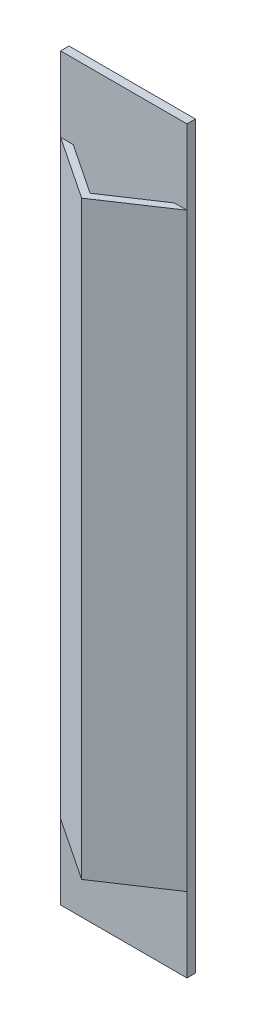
ISO-10303-21;
HEADER;
FILE_DESCRIPTION(('STEP AP214'),'2;1');
FILE_NAME('part.step','',(''),(''),'','','');
FILE_SCHEMA(('AUTOMOTIVE_DESIGN { 1 0 10303 214 1 1 1 1 }'));
ENDSEC;
DATA;
#1=APPLICATION_CONTEXT('core data for automotive mechanical design processes');
#2=APPLICATION_PROTOCOL_DEFINITION('international standard','automotive_design',2000,#1);
#3=PRODUCT_CONTEXT('',#1,'mechanical');
#4=PRODUCT('Part','Part','',(#3));
#5=PRODUCT_RELATED_PRODUCT_CATEGORY('part','',(#4));
#6=PRODUCT_DEFINITION_FORMATION('','',#4);
#7=PRODUCT_DEFINITION_CONTEXT('part definition',#1,'design');
#8=PRODUCT_DEFINITION('design','',#6,#7);
#9=PRODUCT_DEFINITION_SHAPE('','',#8);
#10=(LENGTH_UNIT() NAMED_UNIT(*) SI_UNIT(.MILLI.,.METRE.));
#11=(NAMED_UNIT(*) PLANE_ANGLE_UNIT() SI_UNIT($,.RADIAN.));
#12=(NAMED_UNIT(*) SI_UNIT($,.STERADIAN.) SOLID_ANGLE_UNIT());
#13=UNCERTAINTY_MEASURE_WITH_UNIT(LENGTH_MEASURE(1.E-05),#10,'distance_accuracy_value','');
#14=(GEOMETRIC_REPRESENTATION_CONTEXT(3) GLOBAL_UNCERTAINTY_ASSIGNED_CONTEXT((#13)) GLOBAL_UNIT_ASSIGNED_CONTEXT((#10,
#11,#12)) REPRESENTATION_CONTEXT('',''));
#15=CARTESIAN_POINT('',(0.,0.,0.));
#16=DIRECTION('',(0.,0.,1.));
#17=DIRECTION('',(1.,0.,0.));
#18=AXIS2_PLACEMENT_3D('',#15,#16,#17);
#19=CARTESIAN_POINT('',(-1.905,11.14425,-0.254));
#20=DIRECTION('',(-1.,0.,0.));
#21=DIRECTION('',(0.,-1.,0.));
#22=AXIS2_PLACEMENT_3D('',#19,#20,#21);
#23=PLANE('',#22);
#24=DIRECTION('',(0.,-1.,0.));
#25=VECTOR('',#24,1.);
#26=CARTESIAN_POINT('',(-1.905,11.14425,-0.254));
#27=LINE('',#26,#25);
#28=CARTESIAN_POINT('',(-1.905,11.14425,-0.254));
#29=VERTEX_POINT('',#28);
#30=CARTESIAN_POINT('',(-1.905,-11.14425,-0.254));
#31=VERTEX_POINT('',#30);
#32=EDGE_CURVE('E150',#29,#31,#27,.T.);
#33=ORIENTED_EDGE('',*,*,#32,.T.);
#34=DIRECTION('',(0.,0.,1.));
#35=VECTOR('',#34,1.);
#36=CARTESIAN_POINT('',(-1.905,-11.14425,-0.254));
#37=LINE('',#36,#35);
#38=CARTESIAN_POINT('',(-1.905,-11.14425,0.));
#39=VERTEX_POINT('',#38);
#40=EDGE_CURVE('E159',#31,#39,#37,.T.);
#41=ORIENTED_EDGE('',*,*,#40,.T.);
#42=DIRECTION('',(0.,-1.,0.));
#43=VECTOR('',#42,1.);
#44=CARTESIAN_POINT('',(-1.905,11.14425,0.));
#45=LINE('',#44,#43);
#46=CARTESIAN_POINT('',(-1.905,-8.89,0.));
#47=VERTEX_POINT('',#46);
#48=EDGE_CURVE('E131',#47,#39,#45,.T.);
#49=ORIENTED_EDGE('',*,*,#48,.F.);
#50=DIRECTION('',(0.,-1.,0.));
#51=VECTOR('',#50,1.);
#52=CARTESIAN_POINT('',(-1.905,8.89,0.));
#53=LINE('',#52,#51);
#54=CARTESIAN_POINT('',(-1.905,8.89,0.));
#55=VERTEX_POINT('',#54);
#56=EDGE_CURVE('E54',#55,#47,#53,.T.);
#57=ORIENTED_EDGE('',*,*,#56,.F.);
#58=CARTESIAN_POINT('',(-1.905,11.14425,0.));
#59=VERTEX_POINT('',#58);
#60=EDGE_CURVE('E128',#59,#55,#45,.T.);
#61=ORIENTED_EDGE('',*,*,#60,.F.);
#62=DIRECTION('',(0.,0.,1.));
#63=VECTOR('',#62,1.);
#64=CARTESIAN_POINT('',(-1.905,11.14425,-0.254));
#65=LINE('',#64,#63);
#66=EDGE_CURVE('E151',#29,#59,#65,.T.);
#67=ORIENTED_EDGE('',*,*,#66,.F.);
#68=EDGE_LOOP('',(#33,#41,#49,#57,#61,#67));
#69=FACE_BOUND('',#68,.T.);
#70=ADVANCED_FACE('F31',(#69),#23,.T.);
#71=CARTESIAN_POINT('',(-1.905,11.14425,-0.254));
#72=DIRECTION('',(0.,1.,0.));
#73=DIRECTION('',(0.,0.,1.));
#74=AXIS2_PLACEMENT_3D('',#71,#72,#73);
#75=PLANE('',#74);
#76=DIRECTION('',(-1.,0.,0.));
#77=VECTOR('',#76,1.);
#78=CARTESIAN_POINT('',(-1.905,11.14425,0.));
#79=LINE('',#78,#77);
#80=CARTESIAN_POINT('',(1.905,11.14425,0.));
#81=VERTEX_POINT('',#80);
#82=EDGE_CURVE('E136',#81,#59,#79,.T.);
#83=ORIENTED_EDGE('',*,*,#82,.F.);
#84=DIRECTION('',(0.,0.,1.));
#85=VECTOR('',#84,1.);
#86=CARTESIAN_POINT('',(1.905,11.14425,-0.254));
#87=LINE('',#86,#85);
#88=CARTESIAN_POINT('',(1.905,11.14425,-0.254));
#89=VERTEX_POINT('',#88);
#90=EDGE_CURVE('E154',#89,#81,#87,.T.);
#91=ORIENTED_EDGE('',*,*,#90,.F.);
#92=DIRECTION('',(-1.,0.,0.));
#93=VECTOR('',#92,1.);
#94=CARTESIAN_POINT('',(-1.905,11.14425,-0.254));
#95=LINE('',#94,#93);
#96=EDGE_CURVE('E143',#89,#29,#95,.T.);
#97=ORIENTED_EDGE('',*,*,#96,.T.);
#98=ORIENTED_EDGE('',*,*,#66,.T.);
#99=EDGE_LOOP('',(#83,#91,#97,#98));
#100=FACE_BOUND('',#99,.T.);
#101=ADVANCED_FACE('F189',(#100),#75,.T.);
#102=CARTESIAN_POINT('',(1.905,11.14425,-0.254));
#103=DIRECTION('',(1.,0.,0.));
#104=DIRECTION('',(0.,1.,0.));
#105=AXIS2_PLACEMENT_3D('',#102,#103,#104);
#106=PLANE('',#105);
#107=DIRECTION('',(0.,1.,0.));
#108=VECTOR('',#107,1.);
#109=CARTESIAN_POINT('',(1.905,11.14425,0.));
#110=LINE('',#109,#108);
#111=CARTESIAN_POINT('',(1.905,8.89,0.));
#112=VERTEX_POINT('',#111);
#113=EDGE_CURVE('E140',#112,#81,#110,.T.);
#114=ORIENTED_EDGE('',*,*,#113,.F.);
#115=DIRECTION('',(0.,-1.,0.));
#116=VECTOR('',#115,1.);
#117=CARTESIAN_POINT('',(1.905,8.89,0.));
#118=LINE('',#117,#116);
#119=CARTESIAN_POINT('',(1.905,-8.89,0.));
#120=VERTEX_POINT('',#119);
#121=EDGE_CURVE('E175',#112,#120,#118,.T.);
#122=ORIENTED_EDGE('',*,*,#121,.T.);
#123=CARTESIAN_POINT('',(1.905,-11.14425,0.));
#124=VERTEX_POINT('',#123);
#125=EDGE_CURVE('E146',#124,#120,#110,.T.);
#126=ORIENTED_EDGE('',*,*,#125,.F.);
#127=DIRECTION('',(0.,0.,1.));
#128=VECTOR('',#127,1.);
#129=CARTESIAN_POINT('',(1.905,-11.14425,-0.254));
#130=LINE('',#129,#128);
#131=CARTESIAN_POINT('',(1.905,-11.14425,-0.254));
#132=VERTEX_POINT('',#131);
#133=EDGE_CURVE('E157',#132,#124,#130,.T.);
#134=ORIENTED_EDGE('',*,*,#133,.F.);
#135=DIRECTION('',(0.,1.,0.));
#136=VECTOR('',#135,1.);
#137=CARTESIAN_POINT('',(1.905,11.14425,-0.254));
#138=LINE('',#137,#136);
#139=EDGE_CURVE('E182',#132,#89,#138,.T.);
#140=ORIENTED_EDGE('',*,*,#139,.T.);
#141=ORIENTED_EDGE('',*,*,#90,.T.);
#142=EDGE_LOOP('',(#114,#122,#126,#134,#140,#141));
#143=FACE_BOUND('',#142,.T.);
#144=ADVANCED_FACE('F202',(#143),#106,.T.);
#145=CARTESIAN_POINT('',(-1.905,-11.14425,-0.254));
#146=DIRECTION('',(0.,-1.,0.));
#147=DIRECTION('',(0.,0.,-1.));
#148=AXIS2_PLACEMENT_3D('',#145,#146,#147);
#149=PLANE('',#148);
#150=DIRECTION('',(1.,0.,0.));
#151=VECTOR('',#150,1.);
#152=CARTESIAN_POINT('',(-1.905,-11.14425,0.));
#153=LINE('',#152,#151);
#154=EDGE_CURVE('E137',#39,#124,#153,.T.);
#155=ORIENTED_EDGE('',*,*,#154,.F.);
#156=ORIENTED_EDGE('',*,*,#40,.F.);
#157=DIRECTION('',(1.,0.,0.));
#158=VECTOR('',#157,1.);
#159=CARTESIAN_POINT('',(-1.905,-11.14425,-0.254));
#160=LINE('',#159,#158);
#161=EDGE_CURVE('E180',#31,#132,#160,.T.);
#162=ORIENTED_EDGE('',*,*,#161,.T.);
#163=ORIENTED_EDGE('',*,*,#133,.T.);
#164=EDGE_LOOP('',(#155,#156,#162,#163));
#165=FACE_BOUND('',#164,.T.);
#166=ADVANCED_FACE('F197',(#165),#149,.T.);
#167=CARTESIAN_POINT('',(-1.905,-11.14425,-0.254));
#168=DIRECTION('',(0.,0.,1.));
#169=DIRECTION('',(1.,0.,0.));
#170=AXIS2_PLACEMENT_3D('',#167,#168,#169);
#171=PLANE('',#170);
#172=ORIENTED_EDGE('',*,*,#32,.F.);
#173=ORIENTED_EDGE('',*,*,#96,.F.);
#174=ORIENTED_EDGE('',*,*,#139,.F.);
#175=ORIENTED_EDGE('',*,*,#161,.F.);
#176=EDGE_LOOP('',(#172,#173,#174,#175));
#177=FACE_BOUND('',#176,.T.);
#178=ADVANCED_FACE('F192',(#177),#171,.F.);
#179=CARTESIAN_POINT('',(-1.905,-11.14425,0.));
#180=DIRECTION('',(0.,0.,1.));
#181=DIRECTION('',(1.,0.,0.));
#182=AXIS2_PLACEMENT_3D('',#179,#180,#181);
#183=PLANE('',#182);
#184=DIRECTION('',(-1.,0.,0.));
#185=VECTOR('',#184,1.);
#186=CARTESIAN_POINT('',(-1.905,8.89,0.));
#187=LINE('',#186,#185);
#188=CARTESIAN_POINT('',(1.524,8.89,0.));
#189=VERTEX_POINT('',#188);
#190=EDGE_CURVE('E11',#112,#189,#187,.T.);
#191=ORIENTED_EDGE('',*,*,#190,.F.);
#192=ORIENTED_EDGE('',*,*,#113,.T.);
#193=ORIENTED_EDGE('',*,*,#82,.T.);
#194=ORIENTED_EDGE('',*,*,#60,.T.);
#195=CARTESIAN_POINT('',(-1.524,8.89,0.));
#196=VERTEX_POINT('',#195);
#197=EDGE_CURVE('E39',#196,#55,#187,.T.);
#198=ORIENTED_EDGE('',*,*,#197,.F.);
#199=DIRECTION('',(0.,-1.,0.));
#200=VECTOR('',#199,1.);
#201=CARTESIAN_POINT('',(-1.524,-11.14425,0.));
#202=LINE('',#201,#200);
#203=CARTESIAN_POINT('',(-1.524,-8.89,0.));
#204=VERTEX_POINT('',#203);
#205=EDGE_CURVE('E117',#196,#204,#202,.T.);
#206=ORIENTED_EDGE('',*,*,#205,.T.);
#207=DIRECTION('',(-1.,0.,0.));
#208=VECTOR('',#207,1.);
#209=CARTESIAN_POINT('',(-1.905,-8.89,0.));
#210=LINE('',#209,#208);
#211=EDGE_CURVE('E153',#204,#47,#210,.T.);
#212=ORIENTED_EDGE('',*,*,#211,.T.);
#213=ORIENTED_EDGE('',*,*,#48,.T.);
#214=ORIENTED_EDGE('',*,*,#154,.T.);
#215=ORIENTED_EDGE('',*,*,#125,.T.);
#216=CARTESIAN_POINT('',(1.524,-8.89,0.));
#217=VERTEX_POINT('',#216);
#218=EDGE_CURVE('E116',#120,#217,#210,.T.);
#219=ORIENTED_EDGE('',*,*,#218,.T.);
#220=DIRECTION('',(0.,1.,0.));
#221=VECTOR('',#220,1.);
#222=CARTESIAN_POINT('',(1.524,-11.14425,0.));
#223=LINE('',#222,#221);
#224=EDGE_CURVE('E34',#217,#189,#223,.T.);
#225=ORIENTED_EDGE('',*,*,#224,.T.);
#226=EDGE_LOOP('',(#191,#192,#193,#194,#198,#206,#212,#213,#214,#215,#219,#225));
#227=FACE_BOUND('',#226,.T.);
#228=ADVANCED_FACE('F134',(#227),#183,.T.);
#229=CARTESIAN_POINT('',(-1.905,8.89,0.));
#230=DIRECTION('',(0.554700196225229,0.,-0.832050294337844));
#231=DIRECTION('',(-0.832050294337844,0.,-0.554700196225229));
#232=AXIS2_PLACEMENT_3D('',#229,#230,#231);
#233=PLANE('',#232);
#234=DIRECTION('',(0.832050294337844,0.,0.554700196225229));
#235=VECTOR('',#234,1.);
#236=CARTESIAN_POINT('',(-1.905,-8.89,0.));
#237=LINE('',#236,#235);
#238=CARTESIAN_POINT('',(0.,-8.89,1.27));
#239=VERTEX_POINT('',#238);
#240=EDGE_CURVE('E216',#47,#239,#237,.T.);
#241=ORIENTED_EDGE('',*,*,#240,.T.);
#242=DIRECTION('',(0.,-1.,0.));
#243=VECTOR('',#242,1.);
#244=CARTESIAN_POINT('',(0.,8.89,1.27));
#245=LINE('',#244,#243);
#246=CARTESIAN_POINT('',(0.,8.89,1.27));
#247=VERTEX_POINT('',#246);
#248=EDGE_CURVE('E120',#247,#239,#245,.T.);
#249=ORIENTED_EDGE('',*,*,#248,.F.);
#250=DIRECTION('',(0.832050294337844,0.,0.554700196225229));
#251=VECTOR('',#250,1.);
#252=CARTESIAN_POINT('',(-1.905,8.89,0.));
#253=LINE('',#252,#251);
#254=EDGE_CURVE('E109',#55,#247,#253,.T.);
#255=ORIENTED_EDGE('',*,*,#254,.F.);
#256=ORIENTED_EDGE('',*,*,#56,.T.);
#257=EDGE_LOOP('',(#241,#249,#255,#256));
#258=FACE_BOUND('',#257,.T.);
#259=ADVANCED_FACE('F118',(#258),#233,.F.);
#260=CARTESIAN_POINT('',(0.,8.89,1.27));
#261=DIRECTION('',(-0.554700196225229,0.,-0.832050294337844));
#262=DIRECTION('',(-0.832050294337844,0.,0.554700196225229));
#263=AXIS2_PLACEMENT_3D('',#260,#261,#262);
#264=PLANE('',#263);
#265=DIRECTION('',(0.832050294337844,0.,-0.554700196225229));
#266=VECTOR('',#265,1.);
#267=CARTESIAN_POINT('',(0.,-8.89,1.27));
#268=LINE('',#267,#266);
#269=EDGE_CURVE('E170',#239,#120,#268,.T.);
#270=ORIENTED_EDGE('',*,*,#269,.T.);
#271=ORIENTED_EDGE('',*,*,#121,.F.);
#272=DIRECTION('',(0.832050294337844,0.,-0.554700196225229));
#273=VECTOR('',#272,1.);
#274=CARTESIAN_POINT('',(0.,8.89,1.27));
#275=LINE('',#274,#273);
#276=EDGE_CURVE('E122',#247,#112,#275,.T.);
#277=ORIENTED_EDGE('',*,*,#276,.F.);
#278=ORIENTED_EDGE('',*,*,#248,.T.);
#279=EDGE_LOOP('',(#270,#271,#277,#278));
#280=FACE_BOUND('',#279,.T.);
#281=ADVANCED_FACE('F206',(#280),#264,.F.);
#282=CARTESIAN_POINT('',(1.905,8.89,-0.254));
#283=DIRECTION('',(0.554700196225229,0.,0.832050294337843));
#284=DIRECTION('',(0.832050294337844,0.,-0.554700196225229));
#285=AXIS2_PLACEMENT_3D('',#282,#283,#284);
#286=PLANE('',#285);
#287=ORIENTED_EDGE('',*,*,#224,.F.);
#288=DIRECTION('',(-0.832050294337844,0.,0.554700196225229));
#289=VECTOR('',#288,1.);
#290=CARTESIAN_POINT('',(1.905,-8.89,-0.254));
#291=LINE('',#290,#289);
#292=CARTESIAN_POINT('',(0.,-8.89,1.016));
#293=VERTEX_POINT('',#292);
#294=EDGE_CURVE('E46',#217,#293,#291,.T.);
#295=ORIENTED_EDGE('',*,*,#294,.T.);
#296=DIRECTION('',(0.,-1.,0.));
#297=VECTOR('',#296,1.);
#298=CARTESIAN_POINT('',(0.,8.89,1.016));
#299=LINE('',#298,#297);
#300=CARTESIAN_POINT('',(0.,8.89,1.016));
#301=VERTEX_POINT('',#300);
#302=EDGE_CURVE('E168',#301,#293,#299,.T.);
#303=ORIENTED_EDGE('',*,*,#302,.F.);
#304=DIRECTION('',(-0.832050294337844,0.,0.554700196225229));
#305=VECTOR('',#304,1.);
#306=CARTESIAN_POINT('',(1.905,8.89,-0.254));
#307=LINE('',#306,#305);
#308=EDGE_CURVE('E209',#189,#301,#307,.T.);
#309=ORIENTED_EDGE('',*,*,#308,.F.);
#310=EDGE_LOOP('',(#287,#295,#303,#309));
#311=FACE_BOUND('',#310,.T.);
#312=ADVANCED_FACE('F211',(#311),#286,.F.);
#313=CARTESIAN_POINT('',(0.,8.89,1.016));
#314=DIRECTION('',(-0.554700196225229,0.,0.832050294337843));
#315=DIRECTION('',(0.832050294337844,0.,0.554700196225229));
#316=AXIS2_PLACEMENT_3D('',#313,#314,#315);
#317=PLANE('',#316);
#318=ORIENTED_EDGE('',*,*,#205,.F.);
#319=DIRECTION('',(-0.832050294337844,0.,-0.554700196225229));
#320=VECTOR('',#319,1.);
#321=CARTESIAN_POINT('',(0.,8.89,1.016));
#322=LINE('',#321,#320);
#323=EDGE_CURVE('E112',#301,#196,#322,.T.);
#324=ORIENTED_EDGE('',*,*,#323,.F.);
#325=ORIENTED_EDGE('',*,*,#302,.T.);
#326=DIRECTION('',(-0.832050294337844,0.,-0.554700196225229));
#327=VECTOR('',#326,1.);
#328=CARTESIAN_POINT('',(0.,-8.89,1.016));
#329=LINE('',#328,#327);
#330=EDGE_CURVE('E123',#293,#204,#329,.T.);
#331=ORIENTED_EDGE('',*,*,#330,.T.);
#332=EDGE_LOOP('',(#318,#324,#325,#331));
#333=FACE_BOUND('',#332,.T.);
#334=ADVANCED_FACE('F165',(#333),#317,.F.);
#335=CARTESIAN_POINT('',(-1.905,8.89,0.));
#336=DIRECTION('',(0.,1.,0.));
#337=DIRECTION('',(0.,0.,1.));
#338=AXIS2_PLACEMENT_3D('',#335,#336,#337);
#339=PLANE('',#338);
#340=ORIENTED_EDGE('',*,*,#276,.T.);
#341=ORIENTED_EDGE('',*,*,#190,.T.);
#342=ORIENTED_EDGE('',*,*,#308,.T.);
#343=ORIENTED_EDGE('',*,*,#323,.T.);
#344=ORIENTED_EDGE('',*,*,#197,.T.);
#345=ORIENTED_EDGE('',*,*,#254,.T.);
#346=EDGE_LOOP('',(#340,#341,#342,#343,#344,#345));
#347=FACE_BOUND('',#346,.T.);
#348=ADVANCED_FACE('F108',(#347),#339,.T.);
#349=CARTESIAN_POINT('',(-1.905,-8.89,0.));
#350=DIRECTION('',(0.,1.,0.));
#351=DIRECTION('',(0.,0.,1.));
#352=AXIS2_PLACEMENT_3D('',#349,#350,#351);
#353=PLANE('',#352);
#354=ORIENTED_EDGE('',*,*,#218,.F.);
#355=ORIENTED_EDGE('',*,*,#269,.F.);
#356=ORIENTED_EDGE('',*,*,#240,.F.);
#357=ORIENTED_EDGE('',*,*,#211,.F.);
#358=ORIENTED_EDGE('',*,*,#330,.F.);
#359=ORIENTED_EDGE('',*,*,#294,.F.);
#360=EDGE_LOOP('',(#354,#355,#356,#357,#358,#359));
#361=FACE_BOUND('',#360,.T.);
#362=ADVANCED_FACE('F217',(#361),#353,.F.);
#363=CLOSED_SHELL('',(#70,#101,#144,#166,#178,#228,#259,#281,#312,#334,#348,#362));
#364=MANIFOLD_SOLID_BREP('B2',#363);
#365=ADVANCED_BREP_SHAPE_REPRESENTATION('',(#18,#364),#14);
#366=SHAPE_DEFINITION_REPRESENTATION(#9,#365);
ENDSEC;
END-ISO-10303-21;
